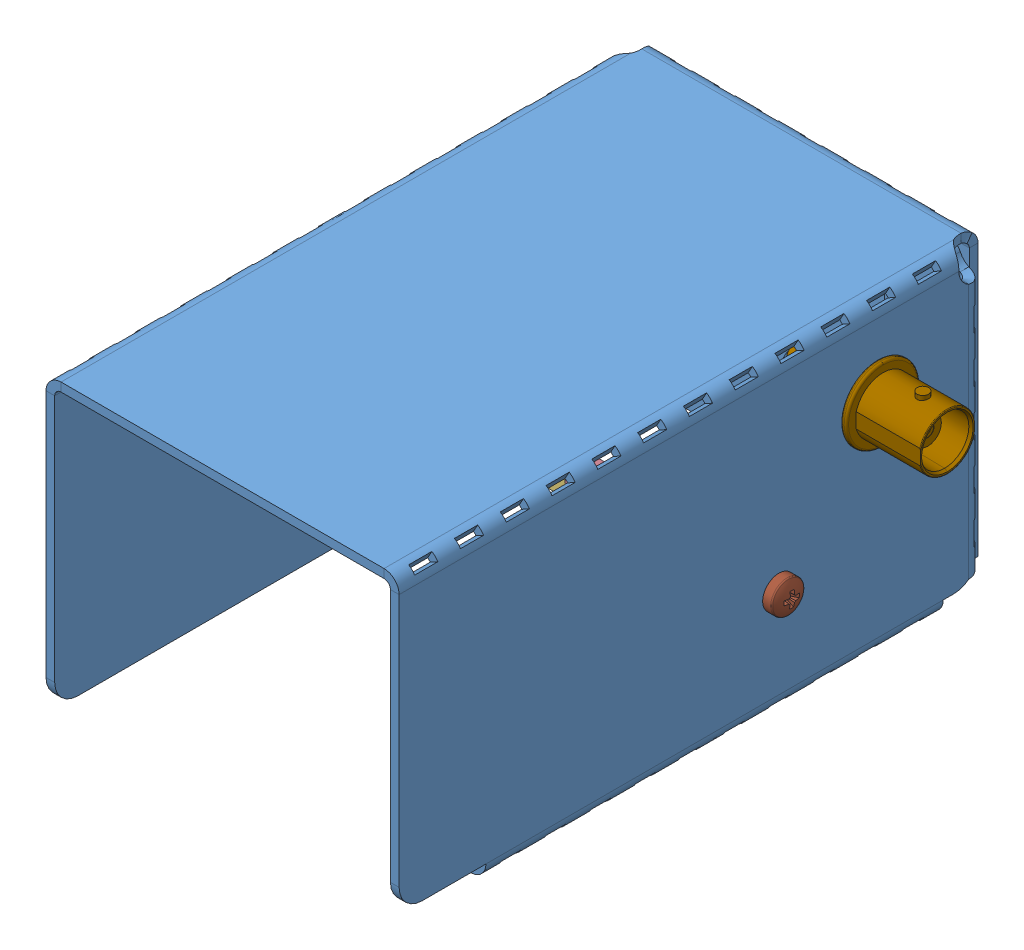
SolidWorks assembly A6303 TF.SLDASM, configuration Default (file format 13000). Lengths in mm.
Overall size (74.96 53 103.6).
14 component instances, 11 part files, 15 mates.
Components (placement in the parent):
- A6303 TF-1: A6303 TF.SLDPRT [Default] at origin size (61.01 53 102.6)
- A6303 CB-1: A6303 CB.SLDASM [Default] at (23 -33.5 34.4) x (0 -0.43499 -0.900435) z (1 0 0) size (7.94 12.11 58.6)
  - Space Plastic M3x6 MF-1: Space Plastic M3x6 MF.SLDPRT [Default] at origin size (6.35 5.5 11)
  - Space M3x20 FF-1: Space M3x20 FF.SLDPRT [Default] at (0 0 -36.6) x (-0.5 -0.866025 0) z (0 0 1) size (6.35 5.5 20)
  - Space M3x20 MF-1: Space M3x20 MF.SLDPRT [Default] at (0 0 -26.6) size (6.35 5.5 25)
  - Space M3x6 MF-1: Space M3x6 MF.SLDPRT [Default] at (0 0 -6) x (0.5 0.866025 0) z (0 0 1) size (6.35 5.5 11)
  - Space M3x6 MF-2: Space M3x6 MF.SLDPRT [Default] at (0 0 -46.6) x (-1 0 0) z (0 0 -1) size (6.35 5.5 11)
  - M3 tab-1: M3 tab.SLDPRT [Default] at (0 0 -6) size (6 10.99 3.17)
- cross recessed binding head screw_jis-1: cross recessed binding head screw_jis.sldprt [JIS B 1111 Binding head screw M3 x 6 --6N] at (-32.4 -33.5 34.4) size (7.84 6.3 6.3)
- rivvet 3mm-1: rivvet 3mm.SLDPRT [Default] at (21 -41 1.2) x (-0.923728 -0.383049 0) z (0 0 -1) size (7.5 7.5 4.8)
- rivvet 3mm-2: rivvet 3mm.SLDPRT [Default] at (-21 -41 1.2) x (-0.923728 -0.383049 0) z (0 0 -1) size (7.5 7.5 4.8)
- Amphenol 112424 -1: Amphenol 112424 .SLDPRT [Default] at (42.6158 -13.5 17.4) x (0 0 1) z (1 0 0) size (14.55 14.55 26.67)
- CMF5549R900BEEB-1: CMF5549R900BEEB.SLDPRT [Default] at (15.4455 -20.5329 24.5091) x (0 -0.710907 -0.703286) z (0 0.703286 -0.710907) size (2.5 5.9 21.1)
- cross recessed pan head screw_jis-1: cross recessed pan head screw_jis.sldprt [JIS B 1111 Cross recessed pan head screw - M3 x 6 - Z --6N] at (32.9 -33.5 34.4) x (-1 0 0) z (0 -0.038827 -0.999246) size (8.35 5.6 5.6)
Mates (geometry in assembly coordinates):
- Concentric1: concentric aligned: cylinder of A6303 TF-1 through (-30.5 -33.5 34.4) axis (1 0 0) radius 1.6; cylinder of A6303 CB-1/Space Plastic M3x6 MF-1 through (25.5 -33.5 34.4) axis (1 0 0) radius 1.4
- Coincident1: coincident anti-aligned: plane of A6303 TF-1 through (29 0 100) normal (-1 0 0); plane of A6303 CB-1/Space Plastic M3x6 MF-1 through (29 -33.5 34.4) normal (1 0 0)
- Concentric3: concentric anti-aligned: cylinder of A6303 TF-1 through (-30.5 -33.5 34.4) axis (1 0 0) radius 1.6; cylinder of cross recessed binding head screw_jis-1 through (-57.8 -33.5 34.4) axis (-1 0 0) radius 1.5
- Coincident3: coincident anti-aligned: plane of A6303 TF-1 through (-30.5 -48 100) normal (-1 0 0); plane of cross recessed binding head screw_jis-1 through (-30.5 -32 34.4) normal (1 0 0)
- Concentric4: concentric anti-aligned: cylinder of A6303 TF-1 through (21 -41 -2.6) axis (0 0 -1) radius 1.25; cylinder of rivvet 3mm-1 through (21 -41 1.2) axis (0 0 1) radius 1.5
- Concentric5: concentric anti-aligned: cylinder of A6303 TF-1 through (-21 -41 -2.6) axis (0 0 -1) radius 1.25; cylinder of rivvet 3mm-2 through (-21 -41 1.2) axis (0 0 1) radius 1.5
- Coincident4: coincident anti-aligned: plane of A6303 TF-1 through (0 0 -2.6) normal (0 0 -1); plane of rivvet 3mm-1 through (19.8125 -38.1364 -2.6) normal (0 0 1)
- Coincident5: coincident anti-aligned: plane of A6303 TF-1 through (0 0 -2.6) normal (0 0 -1); plane of rivvet 3mm-2 through (-22.1875 -38.1364 -2.6) normal (0 0 1)
- Concentric7: concentric anti-aligned: cylinder of A6303 TF-1 through (27.5 -13.5 17.4) axis (1 0 0) radius 4.75; cylinder of Amphenol 112424 -1 through (43.9493 -13.5 17.4) axis (-1 0 0) radius 4.191
- Parallel2: parallel anti-aligned: plane of A6303 TF-1 through (27.5 -17.55 19.8819) normal (0 1 0); plane of Amphenol 112424 -1 through (30.5 -17.4243 9.78) normal (0 -1 0)
- Coincident9: coincident anti-aligned: plane of A6303 TF-1 through (30.5 0 100) normal (1 0 0); plane of Amphenol 112424 -1 through (30.5 -13.5 17.4) normal (-1 0 0)
- Concentric8: concentric aligned: cylinder of Amphenol 112424 -1 through (15.6321 -13.5 17.4) axis (1 0 0) radius 0.7366; cylinder of CMF55 - 49.0-1 through (15.9455 -13.5 17.4) axis (1 0 0) radius 0.3
- Coincident10: coincident anti-aligned: plane of Amphenol 112424 -1 through (16.9455 -13.5 17.4) normal (-1 0 0); plane of CMF55 - 49.0-1 through (16.9455 -13.5 17.4) normal (1 0 0)
- Concentric10: concentric aligned: cylinder of A6303 TF-1 through (-30.5 -33.5 34.4) axis (1 0 0) radius 1.6; cylinder of cross recessed pan head screw_jis-1 through (58.3 -33.5 34.4) axis (1 0 0) radius 1.5
- Coincident11: coincident anti-aligned: plane of A6303 TF-1 through (30.5 0 100) normal (1 0 0); plane of cross recessed pan head screw_jis-1 through (30.5 -32.0011 34.3418) normal (-1 0 0)
